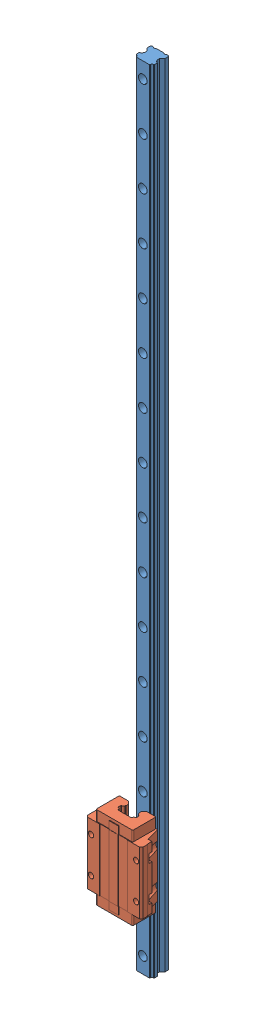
SolidWorks assembly HLW65HC1R1000 E=50.step.sldasm, configuration 默认 (file format 13000). Lengths in mm.
Overall size (70 1000 59).
2 component instances, 2 part files, 0 mates.
Components (placement in the parent):
- HLR65R1000 E=50-1: HLR65R1000 E=50.SLDPRT [默认] at origin size (23 1000 22)
- HLW65HC-1: HLW65HC.SLDPRT [默认] at (0 134.8 37) size (70 104.6 30.5)
